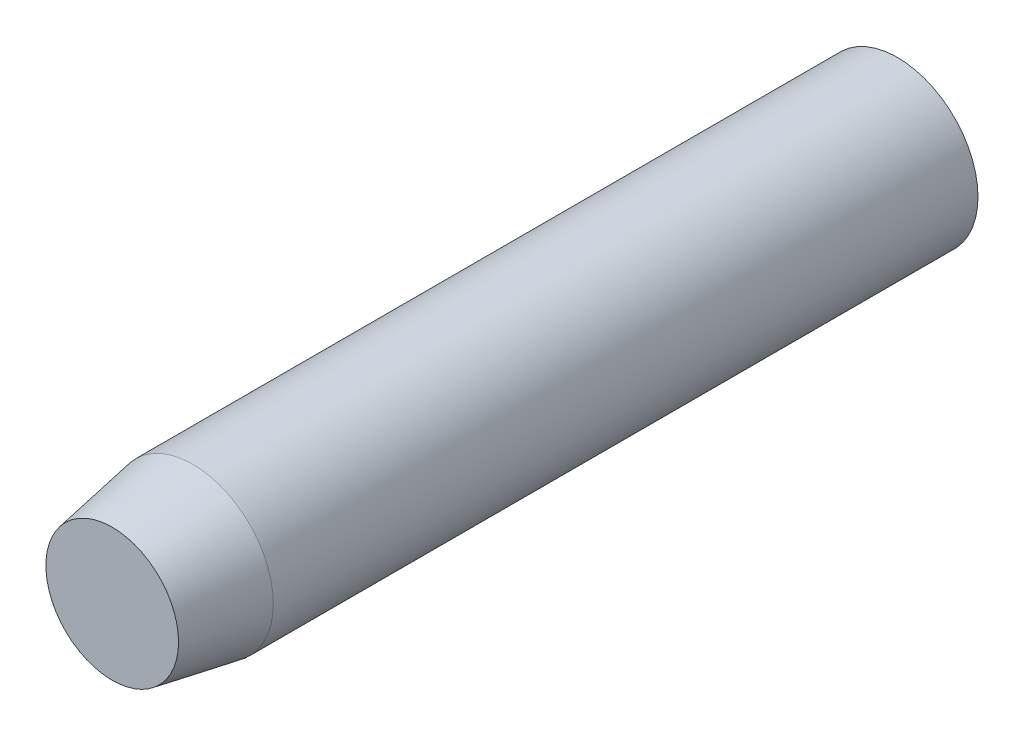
ISO-10303-21;
HEADER;
FILE_DESCRIPTION(('STEP AP214'),'2;1');
FILE_NAME('part.step','',(''),(''),'','','');
FILE_SCHEMA(('AUTOMOTIVE_DESIGN { 1 0 10303 214 1 1 1 1 }'));
ENDSEC;
DATA;
#1=APPLICATION_CONTEXT('core data for automotive mechanical design processes');
#2=APPLICATION_PROTOCOL_DEFINITION('international standard','automotive_design',2000,#1);
#3=PRODUCT_CONTEXT('',#1,'mechanical');
#4=PRODUCT('Part','Part','',(#3));
#5=PRODUCT_RELATED_PRODUCT_CATEGORY('part','',(#4));
#6=PRODUCT_DEFINITION_FORMATION('','',#4);
#7=PRODUCT_DEFINITION_CONTEXT('part definition',#1,'design');
#8=PRODUCT_DEFINITION('design','',#6,#7);
#9=PRODUCT_DEFINITION_SHAPE('','',#8);
#10=(LENGTH_UNIT() NAMED_UNIT(*) SI_UNIT(.MILLI.,.METRE.));
#11=(NAMED_UNIT(*) PLANE_ANGLE_UNIT() SI_UNIT($,.RADIAN.));
#12=(NAMED_UNIT(*) SI_UNIT($,.STERADIAN.) SOLID_ANGLE_UNIT());
#13=UNCERTAINTY_MEASURE_WITH_UNIT(LENGTH_MEASURE(1.E-05),#10,'distance_accuracy_value','');
#14=(GEOMETRIC_REPRESENTATION_CONTEXT(3) GLOBAL_UNCERTAINTY_ASSIGNED_CONTEXT((#13)) GLOBAL_UNIT_ASSIGNED_CONTEXT((#10,
#11,#12)) REPRESENTATION_CONTEXT('',''));
#15=CARTESIAN_POINT('',(0.,0.,0.));
#16=DIRECTION('',(0.,0.,1.));
#17=DIRECTION('',(1.,0.,0.));
#18=AXIS2_PLACEMENT_3D('',#15,#16,#17);
#19=CARTESIAN_POINT('',(0.,0.,19.5));
#20=DIRECTION('',(0.,0.,-1.));
#21=DIRECTION('',(-1.,0.,0.));
#22=AXIS2_PLACEMENT_3D('',#19,#20,#21);
#23=CYLINDRICAL_SURFACE('',#22,2.);
#24=CARTESIAN_POINT('',(0.,0.,17.5));
#25=DIRECTION('',(0.,0.,1.));
#26=DIRECTION('',(1.,0.,0.));
#27=AXIS2_PLACEMENT_3D('',#24,#25,#26);
#28=CIRCLE('',#27,2.);
#29=CARTESIAN_POINT('',(2.,0.,17.5));
#30=VERTEX_POINT('',#29);
#31=EDGE_CURVE('E10',#30,#30,#28,.F.);
#32=ORIENTED_EDGE('',*,*,#31,.T.);
#33=EDGE_LOOP('',(#32));
#34=FACE_BOUND('',#33,.T.);
#35=CARTESIAN_POINT('',(0.,0.,0.));
#36=DIRECTION('',(0.,0.,1.));
#37=DIRECTION('',(1.,0.,0.));
#38=AXIS2_PLACEMENT_3D('',#35,#36,#37);
#39=CIRCLE('',#38,2.);
#40=CARTESIAN_POINT('',(2.,0.,0.));
#41=VERTEX_POINT('',#40);
#42=EDGE_CURVE('E37',#41,#41,#39,.T.);
#43=ORIENTED_EDGE('',*,*,#42,.T.);
#44=EDGE_LOOP('',(#43));
#45=FACE_BOUND('',#44,.T.);
#46=ADVANCED_FACE('F26',(#34,#45),#23,.T.);
#47=CARTESIAN_POINT('',(0.,0.,19.5));
#48=DIRECTION('',(0.,0.,1.));
#49=DIRECTION('',(1.,0.,0.));
#50=AXIS2_PLACEMENT_3D('',#47,#48,#49);
#51=PLANE('',#50);
#52=CARTESIAN_POINT('',(0.,0.,19.5));
#53=DIRECTION('',(0.,0.,1.));
#54=DIRECTION('',(1.,0.,0.));
#55=AXIS2_PLACEMENT_3D('',#52,#53,#54);
#56=CIRCLE('',#55,1.64734603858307);
#57=CARTESIAN_POINT('',(1.64734603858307,0.,19.5));
#58=VERTEX_POINT('',#57);
#59=EDGE_CURVE('E33',#58,#58,#56,.T.);
#60=ORIENTED_EDGE('',*,*,#59,.T.);
#61=EDGE_LOOP('',(#60));
#62=FACE_BOUND('',#61,.T.);
#63=ADVANCED_FACE('F47',(#62),#51,.T.);
#64=CARTESIAN_POINT('',(0.,0.,3.75));
#65=DIRECTION('',(0.,0.,1.));
#66=DIRECTION('',(1.,0.,0.));
#67=AXIS2_PLACEMENT_3D('',#64,#65,#66);
#68=SPHERICAL_SURFACE('',#67,4.25);
#69=ORIENTED_EDGE('',*,*,#42,.F.);
#70=EDGE_LOOP('',(#69));
#71=FACE_BOUND('',#70,.T.);
#72=ADVANCED_FACE('F28',(#71),#68,.T.);
#73=CARTESIAN_POINT('',(0.,0.,19.5));
#74=DIRECTION('',(0.,0.,-1.));
#75=DIRECTION('',(-1.,0.,0.));
#76=AXIS2_PLACEMENT_3D('',#73,#74,#75);
#77=CONICAL_SURFACE('',#76,1.64734603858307,0.17453292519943);
#78=ORIENTED_EDGE('',*,*,#31,.F.);
#79=EDGE_LOOP('',(#78));
#80=FACE_BOUND('',#79,.T.);
#81=ORIENTED_EDGE('',*,*,#59,.F.);
#82=EDGE_LOOP('',(#81));
#83=FACE_BOUND('',#82,.T.);
#84=ADVANCED_FACE('F46',(#80,#83),#77,.T.);
#85=CLOSED_SHELL('',(#46,#63,#72,#84));
#86=MANIFOLD_SOLID_BREP('B2',#85);
#87=ADVANCED_BREP_SHAPE_REPRESENTATION('',(#18,#86),#14);
#88=SHAPE_DEFINITION_REPRESENTATION(#9,#87);
ENDSEC;
END-ISO-10303-21;
